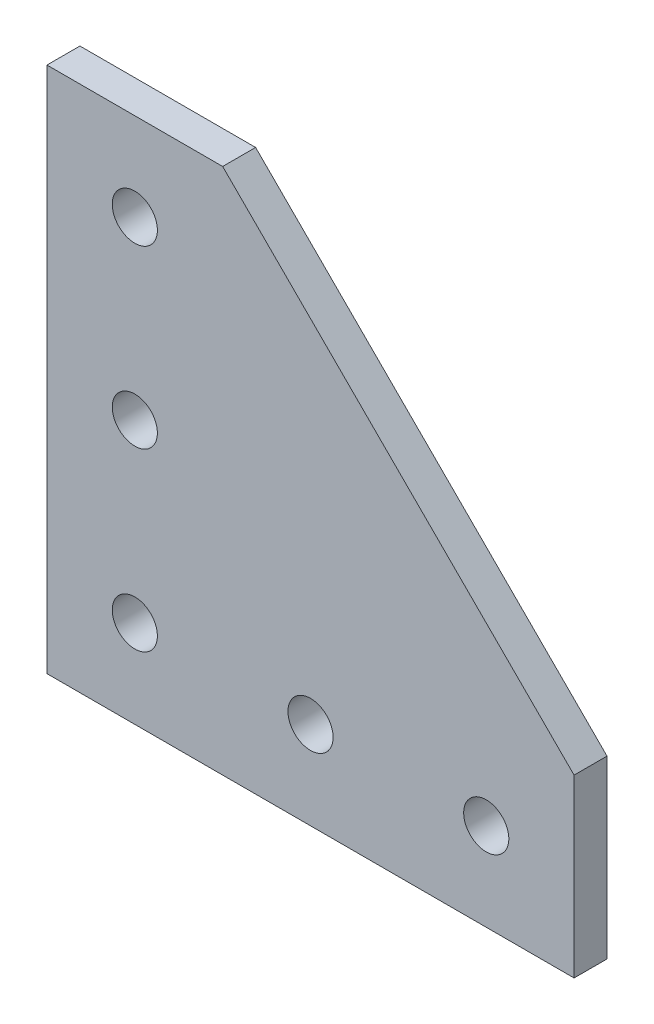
from build123d import *

# Parameters (mm, degrees)
SKETCH1_R           = 3.2639
BOSS_EXTRUDE1_DEPTH = 2.38125


with BuildPart() as part:
    # Sketch1 → Boss-Extrude1 (new, symmetric)
    with BuildSketch(Plane.XY):
        Polygon((0, 0), (0, 76.2), (25.4, 76.2), (76.2, 25.4), (76.2, 0), align=None)
        with Locations(Location((12.7, 12.7, 0), (0, 0, 180))):
            Circle(SKETCH1_R, mode=Mode.SUBTRACT)
        with Locations(Location((38.1, 12.7, 0), (0, 0, 180))):
            Circle(SKETCH1_R, mode=Mode.SUBTRACT)
        with Locations(Location((63.5, 12.7, 0), (0, 0, 180))):
            Circle(SKETCH1_R, mode=Mode.SUBTRACT)
        with Locations(Location((12.7, 38.1, 0), (0, 0, 180))):
            Circle(SKETCH1_R, mode=Mode.SUBTRACT)
        with Locations(Location((12.7, 63.5, 0), (0, 0, 180))):
            Circle(SKETCH1_R, mode=Mode.SUBTRACT)
    extrude(amount=BOSS_EXTRUDE1_DEPTH, both=True)


solid = part.part
